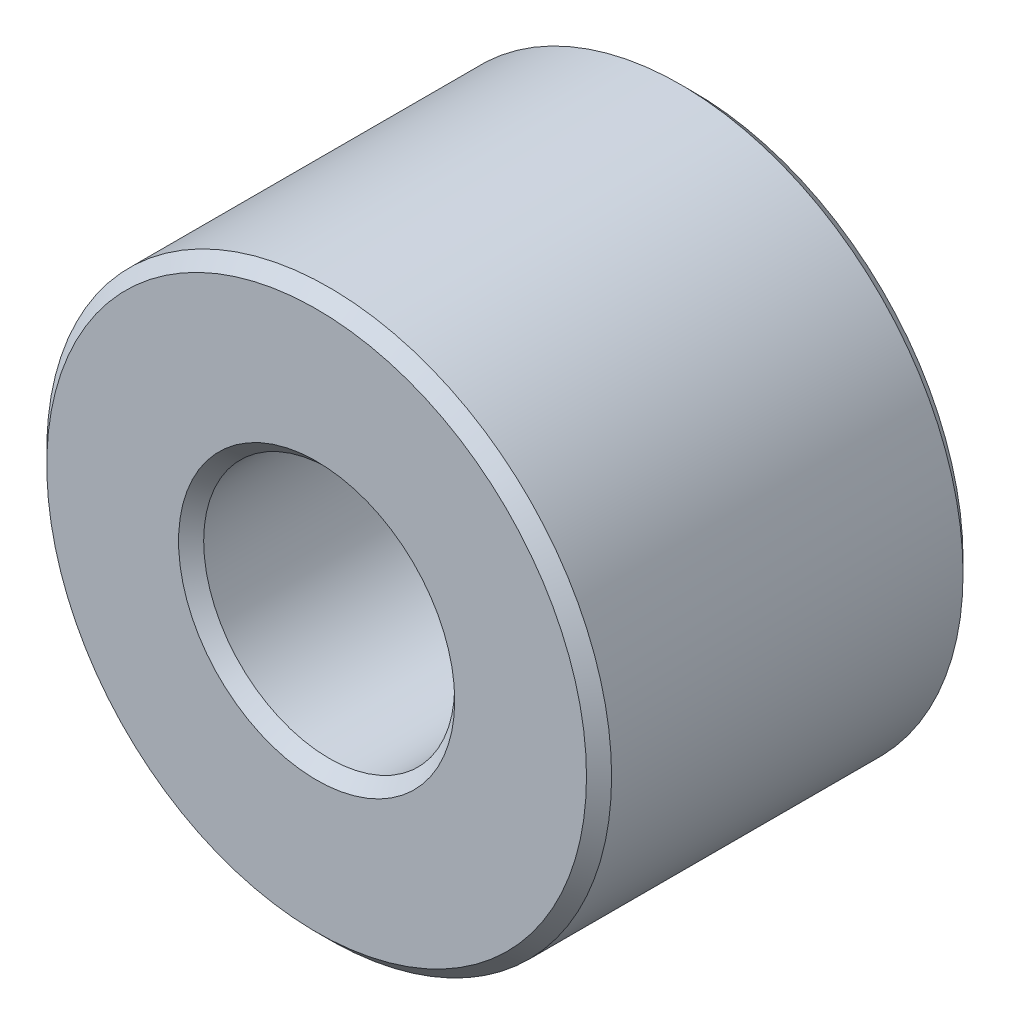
from build123d import *

# Parameters (mm, degrees)
SKETCH1_R           = 22.5
SKETCH1_R_2         = 10
BOSS_EXTRUDE1_DEPTH = 15
CHAMFER1_SIZE       = 1


with BuildPart() as part:
    # Sketch1 → Boss-Extrude1 (new, symmetric)
    with BuildSketch(Plane.XY):
        Circle(SKETCH1_R)
        Circle(SKETCH1_R_2, mode=Mode.SUBTRACT)
    extrude(amount=BOSS_EXTRUDE1_DEPTH, both=True)

    # Chamfer1
    chamfer1_edges = [part.edges().sort_by_distance(p)[0] for p in [
        (-22.5, 0, -15),
        (-22.5, 0, 15),
        (-10, 0, -15),
        (-10, 0, 15),
    ]]
    chamfer(chamfer1_edges, length=CHAMFER1_SIZE)


solid = part.part
